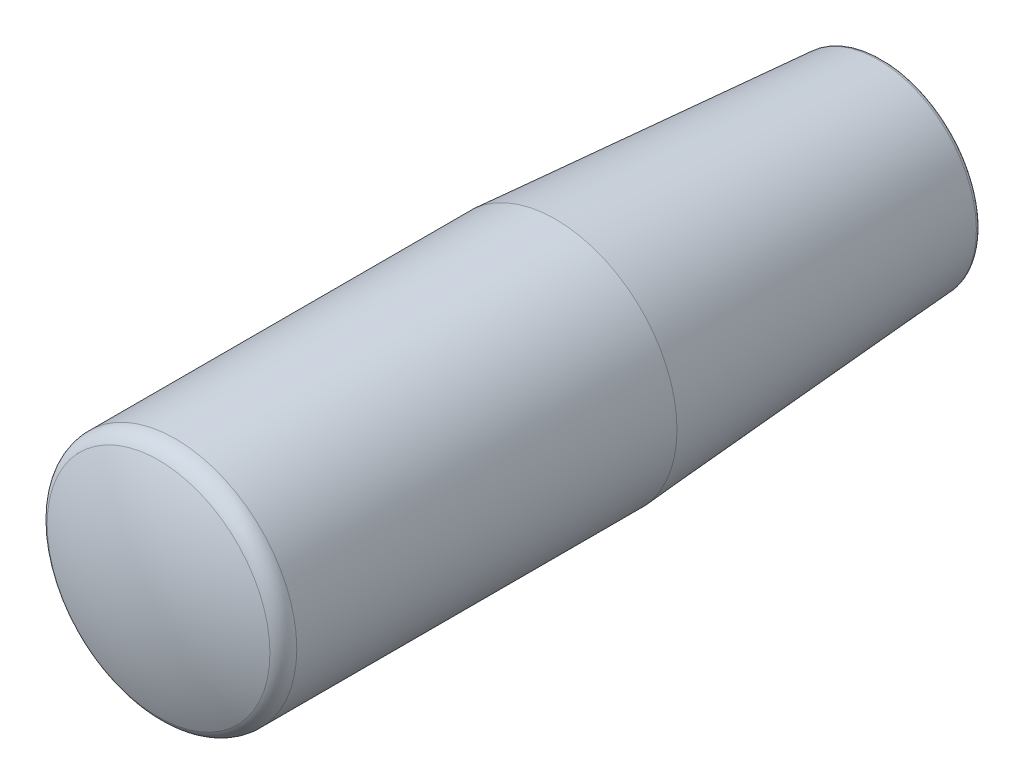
ISO-10303-21;
HEADER;
FILE_DESCRIPTION(('STEP AP214'),'2;1');
FILE_NAME('part.step','',(''),(''),'','','');
FILE_SCHEMA(('AUTOMOTIVE_DESIGN { 1 0 10303 214 1 1 1 1 }'));
ENDSEC;
DATA;
#1=APPLICATION_CONTEXT('core data for automotive mechanical design processes');
#2=APPLICATION_PROTOCOL_DEFINITION('international standard','automotive_design',2000,#1);
#3=PRODUCT_CONTEXT('',#1,'mechanical');
#4=PRODUCT('Part','Part','',(#3));
#5=PRODUCT_RELATED_PRODUCT_CATEGORY('part','',(#4));
#6=PRODUCT_DEFINITION_FORMATION('','',#4);
#7=PRODUCT_DEFINITION_CONTEXT('part definition',#1,'design');
#8=PRODUCT_DEFINITION('design','',#6,#7);
#9=PRODUCT_DEFINITION_SHAPE('','',#8);
#10=(LENGTH_UNIT() NAMED_UNIT(*) SI_UNIT(.MILLI.,.METRE.));
#11=(NAMED_UNIT(*) PLANE_ANGLE_UNIT() SI_UNIT($,.RADIAN.));
#12=(NAMED_UNIT(*) SI_UNIT($,.STERADIAN.) SOLID_ANGLE_UNIT());
#13=UNCERTAINTY_MEASURE_WITH_UNIT(LENGTH_MEASURE(1.E-05),#10,'distance_accuracy_value','');
#14=(GEOMETRIC_REPRESENTATION_CONTEXT(3) GLOBAL_UNCERTAINTY_ASSIGNED_CONTEXT((#13)) GLOBAL_UNIT_ASSIGNED_CONTEXT((#10,
#11,#12)) REPRESENTATION_CONTEXT('',''));
#15=CARTESIAN_POINT('',(0.,0.,0.));
#16=DIRECTION('',(0.,0.,1.));
#17=DIRECTION('',(1.,0.,0.));
#18=AXIS2_PLACEMENT_3D('',#15,#16,#17);
#19=CARTESIAN_POINT('',(0.,0.,-5.));
#20=DIRECTION('',(0.,0.,-1.));
#21=DIRECTION('',(-1.,0.,0.));
#22=AXIS2_PLACEMENT_3D('',#19,#20,#21);
#23=CYLINDRICAL_SURFACE('',#22,6.);
#24=CARTESIAN_POINT('',(0.,0.,50.));
#25=DIRECTION('',(0.,0.,-1.));
#26=DIRECTION('',(-1.,0.,0.));
#27=AXIS2_PLACEMENT_3D('',#24,#25,#26);
#28=CIRCLE('',#27,6.);
#29=CARTESIAN_POINT('',(-6.,0.,50.));
#30=VERTEX_POINT('',#29);
#31=EDGE_CURVE('E8',#30,#30,#28,.T.);
#32=ORIENTED_EDGE('',*,*,#31,.F.);
#33=EDGE_LOOP('',(#32));
#34=FACE_BOUND('',#33,.T.);
#35=CARTESIAN_POINT('',(0.,0.,0.));
#36=DIRECTION('',(0.,0.,-1.));
#37=DIRECTION('',(-1.,0.,0.));
#38=AXIS2_PLACEMENT_3D('',#35,#36,#37);
#39=CIRCLE('',#38,6.);
#40=CARTESIAN_POINT('',(-6.,0.,0.));
#41=VERTEX_POINT('',#40);
#42=EDGE_CURVE('E37',#41,#41,#39,.T.);
#43=ORIENTED_EDGE('',*,*,#42,.T.);
#44=EDGE_LOOP('',(#43));
#45=FACE_BOUND('',#44,.T.);
#46=ADVANCED_FACE('F12',(#34,#45),#23,.F.);
#47=CARTESIAN_POINT('',(0.,6.,50.));
#48=DIRECTION('',(0.,0.,1.));
#49=DIRECTION('',(1.,0.,0.));
#50=AXIS2_PLACEMENT_3D('',#47,#48,#49);
#51=PLANE('',#50);
#52=ORIENTED_EDGE('',*,*,#31,.T.);
#53=EDGE_LOOP('',(#52));
#54=FACE_BOUND('',#53,.T.);
#55=ADVANCED_FACE('F56',(#54),#51,.F.);
#56=CARTESIAN_POINT('',(0.,0.,50.));
#57=DIRECTION('',(-1.,0.,0.));
#58=DIRECTION('',(0.,0.,1.));
#59=AXIS2_PLACEMENT_3D('',#56,#57,#58);
#60=SPHERICAL_SURFACE('',#59,30.);
#61=CARTESIAN_POINT('',(0.,0.,50.));
#62=DIRECTION('',(0.,0.,-1.));
#63=DIRECTION('',(-1.,0.,0.));
#64=AXIS2_PLACEMENT_3D('',#61,#62,#63);
#65=SPHERICAL_SURFACE('',#64,30.);
#66=CARTESIAN_POINT('',(0.,0.,77.5268907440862));
#67=DIRECTION('',(0.,0.,-1.));
#68=DIRECTION('',(-1.,0.,0.));
#69=AXIS2_PLACEMENT_3D('',#66,#67,#68);
#70=CIRCLE('',#69,11.9277108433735);
#71=CARTESIAN_POINT('',(-11.9277108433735,0.,77.5268907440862));
#72=VERTEX_POINT('',#71);
#73=EDGE_CURVE('E18',#72,#72,#70,.T.);
#74=ORIENTED_EDGE('',*,*,#73,.F.);
#75=EDGE_LOOP('',(#74));
#76=FACE_BOUND('',#75,.T.);
#77=ADVANCED_FACE('F62',(#76),#65,.T.);
#78=CARTESIAN_POINT('',(0.,0.,75.7549024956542));
#79=DIRECTION('',(0.,0.,-1.));
#80=DIRECTION('',(-1.,0.,0.));
#81=AXIS2_PLACEMENT_3D('',#78,#79,#80);
#82=TOROIDAL_SURFACE('',#81,11.0003179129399,1.99999999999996);
#83=CARTESIAN_POINT('',(0.,0.,75.7192436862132));
#84=DIRECTION('',(0.,0.,-1.));
#85=DIRECTION('',(-1.,0.,0.));
#86=AXIS2_PLACEMENT_3D('',#83,#84,#85);
#87=CIRCLE('',#86,13.);
#88=CARTESIAN_POINT('',(-13.,0.,75.7192436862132));
#89=VERTEX_POINT('',#88);
#90=EDGE_CURVE('E22',#89,#89,#87,.T.);
#91=ORIENTED_EDGE('',*,*,#90,.F.);
#92=EDGE_LOOP('',(#91));
#93=FACE_BOUND('',#92,.T.);
#94=ORIENTED_EDGE('',*,*,#73,.T.);
#95=EDGE_LOOP('',(#94));
#96=FACE_BOUND('',#95,.T.);
#97=ADVANCED_FACE('F67',(#93,#96),#82,.T.);
#98=CARTESIAN_POINT('',(0.,0.,-5.));
#99=DIRECTION('',(0.,0.,-1.));
#100=DIRECTION('',(-1.,0.,0.));
#101=AXIS2_PLACEMENT_3D('',#98,#99,#100);
#102=CYLINDRICAL_SURFACE('',#101,13.);
#103=ORIENTED_EDGE('',*,*,#90,.T.);
#104=EDGE_LOOP('',(#103));
#105=FACE_BOUND('',#104,.T.);
#106=CARTESIAN_POINT('',(0.,0.,35.));
#107=DIRECTION('',(0.,0.,-1.));
#108=DIRECTION('',(-1.,0.,0.));
#109=AXIS2_PLACEMENT_3D('',#106,#107,#108);
#110=CIRCLE('',#109,13.);
#111=CARTESIAN_POINT('',(-13.,0.,35.));
#112=VERTEX_POINT('',#111);
#113=EDGE_CURVE('E26',#112,#112,#110,.T.);
#114=ORIENTED_EDGE('',*,*,#113,.F.);
#115=EDGE_LOOP('',(#114));
#116=FACE_BOUND('',#115,.T.);
#117=ADVANCED_FACE('F73',(#105,#116),#102,.T.);
#118=CARTESIAN_POINT('',(0.,0.,0.46437647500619));
#119=DIRECTION('',(0.,0.,1.));
#120=DIRECTION('',(1.,0.,0.));
#121=AXIS2_PLACEMENT_3D('',#118,#119,#120);
#122=CONICAL_SURFACE('',#121,10.5331697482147,0.0713074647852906);
#123=ORIENTED_EDGE('',*,*,#113,.T.);
#124=EDGE_LOOP('',(#123));
#125=FACE_BOUND('',#124,.T.);
#126=CARTESIAN_POINT('',(0.,0.,0.46437647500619));
#127=DIRECTION('',(0.,0.,-1.));
#128=DIRECTION('',(-1.,0.,0.));
#129=AXIS2_PLACEMENT_3D('',#126,#127,#128);
#130=CIRCLE('',#129,10.5331697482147);
#131=CARTESIAN_POINT('',(-10.5331697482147,0.,0.46437647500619));
#132=VERTEX_POINT('',#131);
#133=EDGE_CURVE('E31',#132,#132,#130,.T.);
#134=ORIENTED_EDGE('',*,*,#133,.F.);
#135=EDGE_LOOP('',(#134));
#136=FACE_BOUND('',#135,.T.);
#137=ADVANCED_FACE('F52',(#125,#136),#122,.T.);
#138=CARTESIAN_POINT('',(0.,0.,0.5));
#139=DIRECTION('',(0.,0.,-1.));
#140=DIRECTION('',(-1.,0.,0.));
#141=AXIS2_PLACEMENT_3D('',#138,#139,#140);
#142=TOROIDAL_SURFACE('',#141,10.0344403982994,0.499999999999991);
#143=CARTESIAN_POINT('',(0.,0.,0.));
#144=DIRECTION('',(0.,0.,-1.));
#145=DIRECTION('',(-1.,0.,0.));
#146=AXIS2_PLACEMENT_3D('',#143,#144,#145);
#147=CIRCLE('',#146,10.0344403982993);
#148=CARTESIAN_POINT('',(-10.0344403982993,0.,0.));
#149=VERTEX_POINT('',#148);
#150=EDGE_CURVE('E34',#149,#149,#147,.T.);
#151=ORIENTED_EDGE('',*,*,#150,.F.);
#152=EDGE_LOOP('',(#151));
#153=FACE_BOUND('',#152,.T.);
#154=ORIENTED_EDGE('',*,*,#133,.T.);
#155=EDGE_LOOP('',(#154));
#156=FACE_BOUND('',#155,.T.);
#157=ADVANCED_FACE('F44',(#153,#156),#142,.T.);
#158=CARTESIAN_POINT('',(0.,6.,0.));
#159=DIRECTION('',(0.,0.,-1.));
#160=DIRECTION('',(-1.,0.,0.));
#161=AXIS2_PLACEMENT_3D('',#158,#159,#160);
#162=PLANE('',#161);
#163=ORIENTED_EDGE('',*,*,#150,.T.);
#164=EDGE_LOOP('',(#163));
#165=FACE_BOUND('',#164,.T.);
#166=ORIENTED_EDGE('',*,*,#42,.F.);
#167=EDGE_LOOP('',(#166));
#168=FACE_BOUND('',#167,.T.);
#169=ADVANCED_FACE('F42',(#165,#168),#162,.T.);
#170=CLOSED_SHELL('',(#46,#55,#77,#97,#117,#137,#157,#169));
#171=MANIFOLD_SOLID_BREP('B1',#170);
#172=ADVANCED_BREP_SHAPE_REPRESENTATION('',(#18,#171),#14);
#173=SHAPE_DEFINITION_REPRESENTATION(#9,#172);
ENDSEC;
END-ISO-10303-21;
